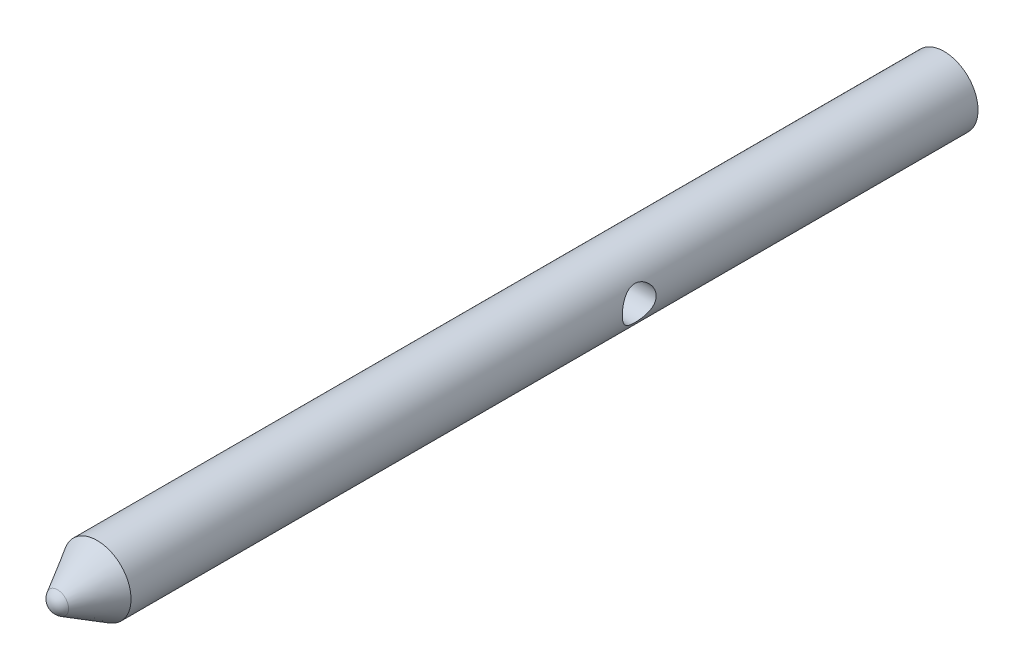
ISO-10303-21;
HEADER;
FILE_DESCRIPTION(('STEP AP214'),'2;1');
FILE_NAME('part.step','',(''),(''),'','','');
FILE_SCHEMA(('AUTOMOTIVE_DESIGN { 1 0 10303 214 1 1 1 1 }'));
ENDSEC;
DATA;
#1=APPLICATION_CONTEXT('core data for automotive mechanical design processes');
#2=APPLICATION_PROTOCOL_DEFINITION('international standard','automotive_design',2000,#1);
#3=PRODUCT_CONTEXT('',#1,'mechanical');
#4=PRODUCT('Part','Part','',(#3));
#5=PRODUCT_RELATED_PRODUCT_CATEGORY('part','',(#4));
#6=PRODUCT_DEFINITION_FORMATION('','',#4);
#7=PRODUCT_DEFINITION_CONTEXT('part definition',#1,'design');
#8=PRODUCT_DEFINITION('design','',#6,#7);
#9=PRODUCT_DEFINITION_SHAPE('','',#8);
#10=(LENGTH_UNIT() NAMED_UNIT(*) SI_UNIT(.MILLI.,.METRE.));
#11=(NAMED_UNIT(*) PLANE_ANGLE_UNIT() SI_UNIT($,.RADIAN.));
#12=(NAMED_UNIT(*) SI_UNIT($,.STERADIAN.) SOLID_ANGLE_UNIT());
#13=UNCERTAINTY_MEASURE_WITH_UNIT(LENGTH_MEASURE(1.E-05),#10,'distance_accuracy_value','');
#14=(GEOMETRIC_REPRESENTATION_CONTEXT(3) GLOBAL_UNCERTAINTY_ASSIGNED_CONTEXT((#13)) GLOBAL_UNIT_ASSIGNED_CONTEXT((#10,
#11,#12)) REPRESENTATION_CONTEXT('',''));
#15=CARTESIAN_POINT('',(0.,0.,0.));
#16=DIRECTION('',(0.,0.,1.));
#17=DIRECTION('',(1.,0.,0.));
#18=AXIS2_PLACEMENT_3D('',#15,#16,#17);
#19=CARTESIAN_POINT('',(0.,0.,103.928203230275));
#20=DIRECTION('',(0.,0.,-1.));
#21=DIRECTION('',(0.,1.,0.));
#22=AXIS2_PLACEMENT_3D('',#19,#20,#21);
#23=SPHERICAL_SURFACE('',#22,1.5);
#24=CARTESIAN_POINT('',(0.,0.,104.678203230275));
#25=DIRECTION('',(0.,0.,-1.));
#26=DIRECTION('',(-1.,0.,0.));
#27=AXIS2_PLACEMENT_3D('',#24,#25,#26);
#28=CIRCLE('',#27,1.29903810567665);
#29=CARTESIAN_POINT('',(-1.29903810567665,0.,104.678203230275));
#30=VERTEX_POINT('',#29);
#31=EDGE_CURVE('E45',#30,#30,#28,.T.);
#32=ORIENTED_EDGE('',*,*,#31,.F.);
#33=EDGE_LOOP('',(#32));
#34=FACE_BOUND('',#33,.T.);
#35=ADVANCED_FACE('F31',(#34),#23,.T.);
#36=CARTESIAN_POINT('',(0.,0.,100.));
#37=DIRECTION('',(0.,0.,-1.));
#38=DIRECTION('',(-1.,0.,0.));
#39=AXIS2_PLACEMENT_3D('',#36,#37,#38);
#40=CONICAL_SURFACE('',#39,3.99999999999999,0.523598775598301);
#41=CARTESIAN_POINT('',(0.,0.,100.));
#42=DIRECTION('',(0.,0.,-1.));
#43=DIRECTION('',(-1.,0.,0.));
#44=AXIS2_PLACEMENT_3D('',#41,#42,#43);
#45=CIRCLE('',#44,3.99999999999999);
#46=CARTESIAN_POINT('',(-3.99999999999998,0.,100.));
#47=VERTEX_POINT('',#46);
#48=EDGE_CURVE('E49',#47,#47,#45,.T.);
#49=CARTESIAN_POINT('',(-1.29903810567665,0.,104.678203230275));
#50=CARTESIAN_POINT('',(-1.32717312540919,0.,104.629471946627));
#51=CARTESIAN_POINT('',(-1.35530814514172,0.,104.580740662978));
#52=CARTESIAN_POINT('',(-1.41157818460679,0.,104.483278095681));
#53=CARTESIAN_POINT('',(-1.43971320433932,0.,104.434546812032));
#54=CARTESIAN_POINT('',(-1.49598324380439,0.,104.337084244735));
#55=CARTESIAN_POINT('',(-1.52411826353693,0.,104.288352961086));
#56=CARTESIAN_POINT('',(-1.580388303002,0.,104.190890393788));
#57=CARTESIAN_POINT('',(-1.60852332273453,0.,104.14215911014));
#58=CARTESIAN_POINT('',(-1.6647933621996,0.,104.044696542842));
#59=CARTESIAN_POINT('',(-1.69292838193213,0.,103.995965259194));
#60=CARTESIAN_POINT('',(-1.7491984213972,0.,103.898502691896));
#61=CARTESIAN_POINT('',(-1.77733344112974,0.,103.849771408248));
#62=CARTESIAN_POINT('',(-1.83360348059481,0.,103.75230884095));
#63=CARTESIAN_POINT('',(-1.86173850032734,0.,103.703577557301));
#64=CARTESIAN_POINT('',(-1.91800853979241,0.,103.606114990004));
#65=CARTESIAN_POINT('',(-1.94614355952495,0.,103.557383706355));
#66=CARTESIAN_POINT('',(-2.00241359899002,0.,103.459921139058));
#67=CARTESIAN_POINT('',(-2.03054861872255,0.,103.411189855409));
#68=CARTESIAN_POINT('',(-2.08681865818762,0.,103.313727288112));
#69=CARTESIAN_POINT('',(-2.11495367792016,0.,103.264996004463));
#70=CARTESIAN_POINT('',(-2.17122371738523,0.,103.167533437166));
#71=CARTESIAN_POINT('',(-2.19935873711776,0.,103.118802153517));
#72=CARTESIAN_POINT('',(-2.25562877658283,0.,103.02133958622));
#73=CARTESIAN_POINT('',(-2.28376379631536,0.,102.972608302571));
#74=CARTESIAN_POINT('',(-2.34003383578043,0.,102.875145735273));
#75=CARTESIAN_POINT('',(-2.36816885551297,0.,102.826414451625));
#76=CARTESIAN_POINT('',(-2.42443889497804,0.,102.728951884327));
#77=CARTESIAN_POINT('',(-2.45257391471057,0.,102.680220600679));
#78=CARTESIAN_POINT('',(-2.50884395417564,0.,102.582758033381));
#79=CARTESIAN_POINT('',(-2.53697897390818,0.,102.534026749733));
#80=CARTESIAN_POINT('',(-2.59324901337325,0.,102.436564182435));
#81=CARTESIAN_POINT('',(-2.62138403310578,0.,102.387832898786));
#82=CARTESIAN_POINT('',(-2.67765407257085,0.,102.290370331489));
#83=CARTESIAN_POINT('',(-2.70578909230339,0.,102.24163904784));
#84=CARTESIAN_POINT('',(-2.76205913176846,0.,102.144176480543));
#85=CARTESIAN_POINT('',(-2.79019415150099,0.,102.095445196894));
#86=CARTESIAN_POINT('',(-2.84646419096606,0.,101.997982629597));
#87=CARTESIAN_POINT('',(-2.87459921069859,0.,101.949251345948));
#88=CARTESIAN_POINT('',(-2.93086925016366,0.,101.851788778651));
#89=CARTESIAN_POINT('',(-2.9590042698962,0.,101.803057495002));
#90=CARTESIAN_POINT('',(-3.01527430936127,0.,101.705594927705));
#91=CARTESIAN_POINT('',(-3.0434093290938,0.,101.656863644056));
#92=CARTESIAN_POINT('',(-3.09967936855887,0.,101.559401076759));
#93=CARTESIAN_POINT('',(-3.12781438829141,0.,101.51066979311));
#94=CARTESIAN_POINT('',(-3.18408442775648,0.,101.413207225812));
#95=CARTESIAN_POINT('',(-3.21221944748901,0.,101.364475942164));
#96=CARTESIAN_POINT('',(-3.26848948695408,0.,101.267013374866));
#97=CARTESIAN_POINT('',(-3.29662450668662,0.,101.218282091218));
#98=CARTESIAN_POINT('',(-3.35289454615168,0.,101.12081952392));
#99=CARTESIAN_POINT('',(-3.38102956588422,0.,101.072088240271));
#100=CARTESIAN_POINT('',(-3.43729960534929,0.,100.974625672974));
#101=CARTESIAN_POINT('',(-3.46543462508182,0.,100.925894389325));
#102=CARTESIAN_POINT('',(-3.52170466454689,0.,100.828431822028));
#103=CARTESIAN_POINT('',(-3.54983968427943,0.,100.779700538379));
#104=CARTESIAN_POINT('',(-3.6061097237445,0.,100.682237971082));
#105=CARTESIAN_POINT('',(-3.63424474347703,0.,100.633506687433));
#106=CARTESIAN_POINT('',(-3.6905147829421,0.,100.536044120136));
#107=CARTESIAN_POINT('',(-3.71864980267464,0.,100.487312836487));
#108=CARTESIAN_POINT('',(-3.77491984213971,0.,100.38985026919));
#109=CARTESIAN_POINT('',(-3.80305486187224,0.,100.341118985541));
#110=CARTESIAN_POINT('',(-3.85932490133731,0.,100.243656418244));
#111=CARTESIAN_POINT('',(-3.88745992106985,0.,100.194925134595));
#112=CARTESIAN_POINT('',(-3.94372996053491,0.,100.097462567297));
#113=CARTESIAN_POINT('',(-3.97186498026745,0.,100.048731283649));
#114=CARTESIAN_POINT('',(-3.99999999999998,0.,100.));
#115=B_SPLINE_CURVE_WITH_KNOTS('',3,(#49,#50,#51,#52,#53,#54,#55,#56,#57,#58,#59,#60,#61,#62,
#63,#64,#65,#66,#67,#68,#69,#70,#71,#72,#73,#74,#75,#76,#77,#78,#79,#80,#81,#82,#83,#84,#85,#86,
#87,#88,#89,#90,#91,#92,#93,#94,#95,#96,#97,#98,#99,#100,#101,#102,#103,#104,#105,#106,#107,
#108,#109,#110,#111,#112,#113,#114),.UNSPECIFIED.,.F.,.F.,(4,2,2,2,2,2,2,2,2,2,2,2,2,2,2,2,2,2,
2,2,2,2,2,2,2,2,2,2,2,2,2,2,4),(0.,0.168810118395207,0.337620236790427,0.506430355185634,
0.675240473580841,0.844050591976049,1.01286071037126,1.18167082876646,1.35048094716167,
1.51929106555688,1.68810118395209,1.85691130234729,2.0257214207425,2.19453153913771,
2.36334165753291,2.53215177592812,2.70096189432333,2.86977201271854,3.03858213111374,
3.20739224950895,3.37620236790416,3.54501248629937,3.71382260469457,3.88263272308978,
4.05144284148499,4.2202529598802,4.3890630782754,4.55787319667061,4.72668331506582,
4.89549343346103,5.06430355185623,5.23311367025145,5.40192378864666),.UNSPECIFIED.);
#116=EDGE_CURVE('BSEAM67',#30,#47,#115,.T.);
#117=ORIENTED_EDGE('',*,*,#31,.T.);
#118=ORIENTED_EDGE('',*,*,#48,.F.);
#119=ORIENTED_EDGE('',*,*,#116,.T.);
#120=ORIENTED_EDGE('',*,*,#116,.F.);
#121=EDGE_LOOP('',(#117,#119,#118,#120));
#122=FACE_BOUND('',#121,.T.);
#123=ADVANCED_FACE('F67',(#122),#40,.T.);
#124=CARTESIAN_POINT('',(0.,0.,-5.));
#125=DIRECTION('',(0.,0.,-1.));
#126=DIRECTION('',(-1.,0.,0.));
#127=AXIS2_PLACEMENT_3D('',#124,#125,#126);
#128=CYLINDRICAL_SURFACE('',#127,3.99999999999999);
#129=CARTESIAN_POINT('',(-3.99999999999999,0.,38.));
#130=CARTESIAN_POINT('',(-3.99999426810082,-0.105143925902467,38.0000066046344));
#131=CARTESIAN_POINT('',(-3.99580982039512,-0.210413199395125,38.0083401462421));
#132=CARTESIAN_POINT('',(-3.97948312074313,-0.417840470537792,38.0413057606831));
#133=CARTESIAN_POINT('',(-3.96732575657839,-0.519992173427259,38.0659687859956));
#134=CARTESIAN_POINT('',(-3.9363255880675,-0.717867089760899,38.1303876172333));
#135=CARTESIAN_POINT('',(-3.91750878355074,-0.813613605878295,38.1700847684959));
#136=CARTESIAN_POINT('',(-3.87491553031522,-0.9969452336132,38.26314124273));
#137=CARTESIAN_POINT('',(-3.8511394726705,-1.08453098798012,38.3164994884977));
#138=CARTESIAN_POINT('',(-3.79912516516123,-1.25501563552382,38.4390344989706));
#139=CARTESIAN_POINT('',(-3.77070398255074,-1.33731042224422,38.5089729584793));
#140=CARTESIAN_POINT('',(-3.71319940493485,-1.48955888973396,38.6610429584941));
#141=CARTESIAN_POINT('',(-3.68411552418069,-1.55950316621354,38.7431837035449));
#142=CARTESIAN_POINT('',(-3.62597902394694,-1.69050400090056,38.9249666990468));
#143=CARTESIAN_POINT('',(-3.59710373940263,-1.75045067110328,39.0254721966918));
#144=CARTESIAN_POINT('',(-3.5457195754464,-1.8523364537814,39.2367346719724));
#145=CARTESIAN_POINT('',(-3.52320615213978,-1.89428842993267,39.3474842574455));
#146=CARTESIAN_POINT('',(-3.48915734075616,-1.95626488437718,39.5693302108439));
#147=CARTESIAN_POINT('',(-3.47704543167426,-1.97745171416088,39.6800089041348));
#148=CARTESIAN_POINT('',(-3.46363779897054,-2.00085398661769,39.9039576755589));
#149=CARTESIAN_POINT('',(-3.46233138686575,-2.00308817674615,40.0172250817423));
#150=CARTESIAN_POINT('',(-3.47021860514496,-1.98937457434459,40.2285720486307));
#151=CARTESIAN_POINT('',(-3.47817527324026,-1.97556911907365,40.3268480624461));
#152=CARTESIAN_POINT('',(-3.501524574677,-1.93387969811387,40.5194438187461));
#153=CARTESIAN_POINT('',(-3.51691957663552,-1.90599124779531,40.6137622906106));
#154=CARTESIAN_POINT('',(-3.55374952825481,-1.83641956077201,40.7984582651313));
#155=CARTESIAN_POINT('',(-3.57531681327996,-1.79443013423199,40.8886927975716));
#156=CARTESIAN_POINT('',(-3.62206808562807,-1.69808337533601,41.06126858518));
#157=CARTESIAN_POINT('',(-3.6472536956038,-1.64372048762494,41.1436062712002));
#158=CARTESIAN_POINT('',(-3.70226315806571,-1.51613210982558,41.3090425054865));
#159=CARTESIAN_POINT('',(-3.73227020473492,-1.44138891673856,41.3909137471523));
#160=CARTESIAN_POINT('',(-3.79095246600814,-1.27911115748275,41.5414708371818));
#161=CARTESIAN_POINT('',(-3.81962703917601,-1.19157051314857,41.6101503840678));
#162=CARTESIAN_POINT('',(-3.87403974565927,-1.0010330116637,41.7353713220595));
#163=CARTESIAN_POINT('',(-3.89957968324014,-0.897507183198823,41.7912009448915));
#164=CARTESIAN_POINT('',(-3.94315762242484,-0.6809324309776,41.884194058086));
#165=CARTESIAN_POINT('',(-3.96120157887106,-0.567891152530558,41.9213723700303));
#166=CARTESIAN_POINT('',(-3.9864866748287,-0.345532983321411,41.9729508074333));
#167=CARTESIAN_POINT('',(-3.99449876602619,-0.236683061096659,41.9889824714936));
#168=CARTESIAN_POINT('',(-4.00146026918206,-0.0175591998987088,42.002929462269));
#169=CARTESIAN_POINT('',(-4.00041397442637,0.0927140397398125,42.0008533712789));
#170=CARTESIAN_POINT('',(-3.98982384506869,0.30246594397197,41.9795866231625));
#171=CARTESIAN_POINT('',(-3.98094491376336,0.402118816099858,41.96173493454));
#172=CARTESIAN_POINT('',(-3.9564434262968,0.59681378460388,41.9115238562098));
#173=CARTESIAN_POINT('',(-3.94082012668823,0.691855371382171,41.879162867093));
#174=CARTESIAN_POINT('',(-3.90368502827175,0.877777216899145,41.8000030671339));
#175=CARTESIAN_POINT('',(-3.88201763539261,0.968460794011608,41.7528178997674));
#176=CARTESIAN_POINT('',(-3.83487948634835,1.14092272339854,41.6457849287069));
#177=CARTESIAN_POINT('',(-3.80940711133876,1.22269725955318,41.5859317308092));
#178=CARTESIAN_POINT('',(-3.75416442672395,1.38353537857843,41.4484791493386));
#179=CARTESIAN_POINT('',(-3.72421769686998,1.46154415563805,41.3697142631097));
#180=CARTESIAN_POINT('',(-3.66524783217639,1.60371264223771,41.2001496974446));
#181=CARTESIAN_POINT('',(-3.63622534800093,1.66786277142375,41.1093417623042));
#182=CARTESIAN_POINT('',(-3.58102384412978,1.78341582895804,40.9127126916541));
#183=CARTESIAN_POINT('',(-3.55505059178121,1.8340509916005,40.806377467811));
#184=CARTESIAN_POINT('',(-3.51148144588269,1.91616565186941,40.5849798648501));
#185=CARTESIAN_POINT('',(-3.49387476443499,1.94766983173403,40.4699289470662));
#186=CARTESIAN_POINT('',(-3.47123002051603,1.98772337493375,40.2461795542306));
#187=CARTESIAN_POINT('',(-3.46514766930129,1.99818599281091,40.1379314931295));
#188=CARTESIAN_POINT('',(-3.46330709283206,2.00137830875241,39.921105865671));
#189=CARTESIAN_POINT('',(-3.46754439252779,1.99411569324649,39.8125284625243));
#190=CARTESIAN_POINT('',(-3.48475724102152,1.96385225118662,39.6090329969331));
#191=CARTESIAN_POINT('',(-3.49686188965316,1.94241662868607,39.5137990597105));
#192=CARTESIAN_POINT('',(-3.52742032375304,1.88635071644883,39.3283837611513));
#193=CARTESIAN_POINT('',(-3.54587615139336,1.85171618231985,39.2382040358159));
#194=CARTESIAN_POINT('',(-3.5885706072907,1.76763149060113,39.0587502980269));
#195=CARTESIAN_POINT('',(-3.6131144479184,1.71734227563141,38.9699441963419));
#196=CARTESIAN_POINT('',(-3.6647066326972,1.60430194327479,38.8014509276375));
#197=CARTESIAN_POINT('',(-3.6917562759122,1.54154434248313,38.7217685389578));
#198=CARTESIAN_POINT('',(-3.74924646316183,1.39640665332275,38.5637160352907));
#199=CARTESIAN_POINT('',(-3.77969966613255,1.31256884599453,38.4866817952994));
#200=CARTESIAN_POINT('',(-3.83755504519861,1.1323096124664,38.3474740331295));
#201=CARTESIAN_POINT('',(-3.86495557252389,1.0358814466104,38.2853085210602));
#202=CARTESIAN_POINT('',(-3.91396019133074,0.831863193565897,38.1775272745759));
#203=CARTESIAN_POINT('',(-3.93552192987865,0.724199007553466,38.1320316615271));
#204=CARTESIAN_POINT('',(-3.97002682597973,0.501484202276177,38.0603836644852));
#205=CARTESIAN_POINT('',(-3.98299446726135,0.386455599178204,38.0341763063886));
#206=CARTESIAN_POINT('',(-3.99390923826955,0.225203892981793,38.0122051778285));
#207=CARTESIAN_POINT('',(-3.99618730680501,0.180323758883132,38.0076347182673));
#208=CARTESIAN_POINT('',(-3.9992339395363,0.0903034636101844,38.0015306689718));
#209=CARTESIAN_POINT('',(-4.00000246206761,0.0451632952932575,37.9999971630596));
#210=CARTESIAN_POINT('',(-3.99999999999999,0.,38.));
#211=B_SPLINE_CURVE_WITH_KNOTS('',3,(#129,#130,#131,#132,#133,#134,#135,#136,#137,#138,#139,
#140,#141,#142,#143,#144,#145,#146,#147,#148,#149,#150,#151,#152,#153,#154,#155,#156,#157,#158,
#159,#160,#161,#162,#163,#164,#165,#166,#167,#168,#169,#170,#171,#172,#173,#174,#175,#176,#177,
#178,#179,#180,#181,#182,#183,#184,#185,#186,#187,#188,#189,#190,#191,#192,#193,#194,#195,#196,
#197,#198,#199,#200,#201,#202,#203,#204,#205,#206,#207,#208,#209,#210),.UNSPECIFIED.,.T.,.F.,(4,
2,2,2,2,2,2,2,2,2,2,2,2,2,2,2,2,2,2,2,2,2,2,2,2,2,2,2,2,2,2,2,2,2,2,2,2,2,2,2,4),(0.,
0.315248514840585,0.631096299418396,0.945724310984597,1.26032752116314,1.59396351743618,
1.92785247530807,2.28763452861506,2.64715895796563,2.98516024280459,3.32282714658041,
3.62011424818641,3.91749607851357,4.22180480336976,4.52625042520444,4.86929882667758,
5.21251069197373,5.57166044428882,5.93052433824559,6.25966580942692,6.58865129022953,
6.89213813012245,7.19565843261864,7.50785712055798,7.82018901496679,8.16319221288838,
8.50643177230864,8.86629364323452,9.22569023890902,9.55058615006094,9.87534119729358,
10.1691586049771,10.463070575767,10.7767291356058,11.0905512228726,11.4425048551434,
11.7946476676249,12.1492802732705,12.502898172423,12.6383056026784,12.7737167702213),.UNSPECIFIED.);
#212=CARTESIAN_POINT('',(-3.99999999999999,0.,38.));
#213=VERTEX_POINT('',#212);
#214=EDGE_CURVE('E10',#213,#213,#211,.T.);
#215=ORIENTED_EDGE('',*,*,#214,.F.);
#216=EDGE_LOOP('',(#215));
#217=FACE_BOUND('',#216,.T.);
#218=CARTESIAN_POINT('',(4.,0.,38.));
#219=CARTESIAN_POINT('',(3.99999426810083,0.105143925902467,38.0000066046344));
#220=CARTESIAN_POINT('',(3.99580982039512,0.210413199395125,38.0083401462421));
#221=CARTESIAN_POINT('',(3.97948312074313,0.417840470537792,38.0413057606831));
#222=CARTESIAN_POINT('',(3.96732575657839,0.519992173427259,38.0659687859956));
#223=CARTESIAN_POINT('',(3.9363255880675,0.717867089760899,38.1303876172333));
#224=CARTESIAN_POINT('',(3.91750878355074,0.813613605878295,38.1700847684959));
#225=CARTESIAN_POINT('',(3.87491553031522,0.9969452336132,38.26314124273));
#226=CARTESIAN_POINT('',(3.8511394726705,1.08453098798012,38.3164994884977));
#227=CARTESIAN_POINT('',(3.79912516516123,1.25501563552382,38.4390344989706));
#228=CARTESIAN_POINT('',(3.77070398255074,1.33731042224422,38.5089729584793));
#229=CARTESIAN_POINT('',(3.71319940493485,1.48955888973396,38.6610429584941));
#230=CARTESIAN_POINT('',(3.68411552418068,1.55950316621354,38.7431837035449));
#231=CARTESIAN_POINT('',(3.62597902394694,1.69050400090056,38.9249666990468));
#232=CARTESIAN_POINT('',(3.59710373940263,1.75045067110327,39.0254721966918));
#233=CARTESIAN_POINT('',(3.5457195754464,1.85233645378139,39.2367346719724));
#234=CARTESIAN_POINT('',(3.52320615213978,1.89428842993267,39.3474842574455));
#235=CARTESIAN_POINT('',(3.48915734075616,1.95626488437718,39.5693302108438));
#236=CARTESIAN_POINT('',(3.47704543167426,1.97745171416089,39.6800089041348));
#237=CARTESIAN_POINT('',(3.46363779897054,2.00085398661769,39.9039576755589));
#238=CARTESIAN_POINT('',(3.46233138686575,2.00308817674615,40.0172250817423));
#239=CARTESIAN_POINT('',(3.47021860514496,1.98937457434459,40.2285720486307));
#240=CARTESIAN_POINT('',(3.47817527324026,1.97556911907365,40.3268480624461));
#241=CARTESIAN_POINT('',(3.501524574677,1.93387969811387,40.5194438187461));
#242=CARTESIAN_POINT('',(3.51691957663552,1.90599124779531,40.6137622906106));
#243=CARTESIAN_POINT('',(3.55374952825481,1.83641956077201,40.7984582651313));
#244=CARTESIAN_POINT('',(3.57531681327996,1.79443013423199,40.8886927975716));
#245=CARTESIAN_POINT('',(3.62206808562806,1.69808337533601,41.06126858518));
#246=CARTESIAN_POINT('',(3.6472536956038,1.64372048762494,41.1436062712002));
#247=CARTESIAN_POINT('',(3.70226315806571,1.51613210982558,41.3090425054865));
#248=CARTESIAN_POINT('',(3.73227020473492,1.44138891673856,41.3909137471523));
#249=CARTESIAN_POINT('',(3.79095246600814,1.27911115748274,41.5414708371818));
#250=CARTESIAN_POINT('',(3.81962703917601,1.19157051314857,41.6101503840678));
#251=CARTESIAN_POINT('',(3.87403974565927,1.0010330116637,41.7353713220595));
#252=CARTESIAN_POINT('',(3.89957968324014,0.897507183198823,41.7912009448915));
#253=CARTESIAN_POINT('',(3.94315762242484,0.6809324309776,41.884194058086));
#254=CARTESIAN_POINT('',(3.96120157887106,0.567891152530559,41.9213723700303));
#255=CARTESIAN_POINT('',(3.9864866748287,0.345532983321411,41.9729508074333));
#256=CARTESIAN_POINT('',(3.99449876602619,0.236683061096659,41.9889824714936));
#257=CARTESIAN_POINT('',(4.00146026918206,0.0175591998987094,42.002929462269));
#258=CARTESIAN_POINT('',(4.00041397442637,-0.0927140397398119,42.0008533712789));
#259=CARTESIAN_POINT('',(3.98982384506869,-0.302465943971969,41.9795866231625));
#260=CARTESIAN_POINT('',(3.98094491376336,-0.402118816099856,41.96173493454));
#261=CARTESIAN_POINT('',(3.9564434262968,-0.596813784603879,41.9115238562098));
#262=CARTESIAN_POINT('',(3.94082012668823,-0.691855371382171,41.879162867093));
#263=CARTESIAN_POINT('',(3.90368502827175,-0.877777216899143,41.8000030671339));
#264=CARTESIAN_POINT('',(3.88201763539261,-0.968460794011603,41.7528178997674));
#265=CARTESIAN_POINT('',(3.83487948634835,-1.14092272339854,41.6457849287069));
#266=CARTESIAN_POINT('',(3.80940711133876,-1.22269725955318,41.5859317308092));
#267=CARTESIAN_POINT('',(3.75416442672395,-1.38353537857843,41.4484791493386));
#268=CARTESIAN_POINT('',(3.72421769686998,-1.46154415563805,41.3697142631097));
#269=CARTESIAN_POINT('',(3.66524783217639,-1.60371264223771,41.2001496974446));
#270=CARTESIAN_POINT('',(3.63622534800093,-1.66786277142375,41.1093417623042));
#271=CARTESIAN_POINT('',(3.58102384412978,-1.78341582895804,40.9127126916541));
#272=CARTESIAN_POINT('',(3.55505059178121,-1.8340509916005,40.806377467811));
#273=CARTESIAN_POINT('',(3.51148144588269,-1.91616565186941,40.5849798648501));
#274=CARTESIAN_POINT('',(3.49387476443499,-1.94766983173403,40.4699289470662));
#275=CARTESIAN_POINT('',(3.47123002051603,-1.98772337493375,40.2461795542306));
#276=CARTESIAN_POINT('',(3.46514766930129,-1.99818599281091,40.1379314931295));
#277=CARTESIAN_POINT('',(3.46330709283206,-2.00137830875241,39.921105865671));
#278=CARTESIAN_POINT('',(3.46754439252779,-1.99411569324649,39.8125284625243));
#279=CARTESIAN_POINT('',(3.48475724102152,-1.96385225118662,39.6090329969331));
#280=CARTESIAN_POINT('',(3.49686188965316,-1.94241662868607,39.5137990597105));
#281=CARTESIAN_POINT('',(3.52742032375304,-1.88635071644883,39.3283837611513));
#282=CARTESIAN_POINT('',(3.54587615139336,-1.85171618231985,39.2382040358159));
#283=CARTESIAN_POINT('',(3.5885706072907,-1.76763149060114,39.0587502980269));
#284=CARTESIAN_POINT('',(3.6131144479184,-1.71734227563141,38.9699441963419));
#285=CARTESIAN_POINT('',(3.6647066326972,-1.60430194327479,38.8014509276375));
#286=CARTESIAN_POINT('',(3.6917562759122,-1.54154434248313,38.7217685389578));
#287=CARTESIAN_POINT('',(3.74924646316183,-1.39640665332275,38.5637160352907));
#288=CARTESIAN_POINT('',(3.77969966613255,-1.31256884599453,38.4866817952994));
#289=CARTESIAN_POINT('',(3.83755504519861,-1.1323096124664,38.3474740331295));
#290=CARTESIAN_POINT('',(3.86495557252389,-1.0358814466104,38.2853085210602));
#291=CARTESIAN_POINT('',(3.91396019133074,-0.831863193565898,38.1775272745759));
#292=CARTESIAN_POINT('',(3.93552192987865,-0.724199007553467,38.1320316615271));
#293=CARTESIAN_POINT('',(3.97002682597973,-0.501484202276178,38.0603836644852));
#294=CARTESIAN_POINT('',(3.98299446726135,-0.386455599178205,38.0341763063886));
#295=CARTESIAN_POINT('',(3.99390923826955,-0.225203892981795,38.0122051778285));
#296=CARTESIAN_POINT('',(3.99618730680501,-0.180323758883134,38.0076347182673));
#297=CARTESIAN_POINT('',(3.99923393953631,-0.0903034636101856,38.0015306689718));
#298=CARTESIAN_POINT('',(4.00000246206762,-0.0451632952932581,37.9999971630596));
#299=CARTESIAN_POINT('',(4.,0.,38.));
#300=B_SPLINE_CURVE_WITH_KNOTS('',3,(#218,#219,#220,#221,#222,#223,#224,#225,#226,#227,#228,
#229,#230,#231,#232,#233,#234,#235,#236,#237,#238,#239,#240,#241,#242,#243,#244,#245,#246,#247,
#248,#249,#250,#251,#252,#253,#254,#255,#256,#257,#258,#259,#260,#261,#262,#263,#264,#265,#266,
#267,#268,#269,#270,#271,#272,#273,#274,#275,#276,#277,#278,#279,#280,#281,#282,#283,#284,#285,
#286,#287,#288,#289,#290,#291,#292,#293,#294,#295,#296,#297,#298,#299),.UNSPECIFIED.,.T.,.F.,(4,
2,2,2,2,2,2,2,2,2,2,2,2,2,2,2,2,2,2,2,2,2,2,2,2,2,2,2,2,2,2,2,2,2,2,2,2,2,2,2,4),(0.,
0.315248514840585,0.631096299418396,0.945724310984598,1.26032752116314,1.59396351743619,
1.92785247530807,2.28763452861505,2.64715895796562,2.9851602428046,3.32282714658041,
3.6201142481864,3.91749607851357,4.22180480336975,4.52625042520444,4.86929882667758,
5.21251069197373,5.57166044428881,5.93052433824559,6.25966580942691,6.58865129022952,
6.89213813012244,7.19565843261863,7.50785712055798,7.82018901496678,8.16319221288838,
8.50643177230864,8.86629364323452,9.22569023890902,9.55058615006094,9.87534119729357,
10.1691586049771,10.463070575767,10.7767291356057,11.0905512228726,11.4425048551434,
11.7946476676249,12.1492802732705,12.502898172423,12.6383056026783,12.7737167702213),.UNSPECIFIED.);
#301=CARTESIAN_POINT('',(4.,0.,38.));
#302=VERTEX_POINT('',#301);
#303=EDGE_CURVE('E41',#302,#302,#300,.T.);
#304=ORIENTED_EDGE('',*,*,#303,.F.);
#305=EDGE_LOOP('',(#304));
#306=FACE_BOUND('',#305,.T.);
#307=ORIENTED_EDGE('',*,*,#48,.T.);
#308=EDGE_LOOP('',(#307));
#309=FACE_BOUND('',#308,.T.);
#310=CARTESIAN_POINT('',(0.,0.,0.));
#311=DIRECTION('',(0.,0.,-1.));
#312=DIRECTION('',(-1.,0.,0.));
#313=AXIS2_PLACEMENT_3D('',#310,#311,#312);
#314=CIRCLE('',#313,4.);
#315=CARTESIAN_POINT('',(-4.,0.,0.));
#316=VERTEX_POINT('',#315);
#317=EDGE_CURVE('E81',#316,#316,#314,.T.);
#318=ORIENTED_EDGE('',*,*,#317,.F.);
#319=EDGE_LOOP('',(#318));
#320=FACE_BOUND('',#319,.T.);
#321=ADVANCED_FACE('F54',(#217,#306,#309,#320),#128,.T.);
#322=CARTESIAN_POINT('',(0.,0.,0.));
#323=DIRECTION('',(0.,0.,-1.));
#324=DIRECTION('',(-1.,0.,0.));
#325=AXIS2_PLACEMENT_3D('',#322,#323,#324);
#326=PLANE('',#325);
#327=ORIENTED_EDGE('',*,*,#317,.T.);
#328=EDGE_LOOP('',(#327));
#329=FACE_BOUND('',#328,.T.);
#330=ADVANCED_FACE('F60',(#329),#326,.T.);
#331=CARTESIAN_POINT('',(-4.,0.,40.));
#332=DIRECTION('',(1.,0.,0.));
#333=DIRECTION('',(0.,0.,-1.));
#334=AXIS2_PLACEMENT_3D('',#331,#332,#333);
#335=CYLINDRICAL_SURFACE('',#334,2.);
#336=ORIENTED_EDGE('',*,*,#214,.T.);
#337=EDGE_LOOP('',(#336));
#338=FACE_BOUND('',#337,.T.);
#339=ORIENTED_EDGE('',*,*,#303,.T.);
#340=EDGE_LOOP('',(#339));
#341=FACE_BOUND('',#340,.T.);
#342=ADVANCED_FACE('F57',(#338,#341),#335,.F.);
#343=CLOSED_SHELL('',(#35,#123,#321,#330,#342));
#344=MANIFOLD_SOLID_BREP('B2',#343);
#345=ADVANCED_BREP_SHAPE_REPRESENTATION('',(#18,#344),#14);
#346=SHAPE_DEFINITION_REPRESENTATION(#9,#345);
ENDSEC;
END-ISO-10303-21;
